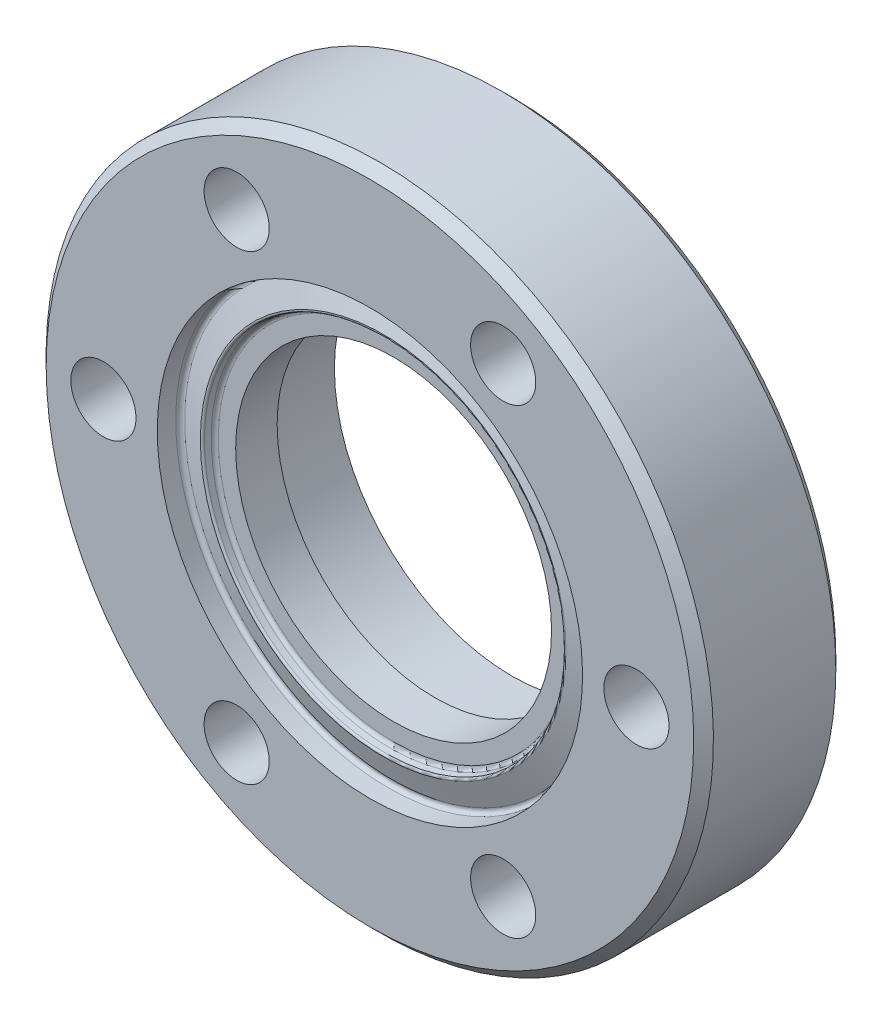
ISO-10303-21;
HEADER;
FILE_DESCRIPTION(('STEP AP214'),'2;1');
FILE_NAME('part.step','',(''),(''),'','','');
FILE_SCHEMA(('AUTOMOTIVE_DESIGN { 1 0 10303 214 1 1 1 1 }'));
ENDSEC;
DATA;
#1=APPLICATION_CONTEXT('core data for automotive mechanical design processes');
#2=APPLICATION_PROTOCOL_DEFINITION('international standard','automotive_design',2000,#1);
#3=PRODUCT_CONTEXT('',#1,'mechanical');
#4=PRODUCT('Part','Part','',(#3));
#5=PRODUCT_RELATED_PRODUCT_CATEGORY('part','',(#4));
#6=PRODUCT_DEFINITION_FORMATION('','',#4);
#7=PRODUCT_DEFINITION_CONTEXT('part definition',#1,'design');
#8=PRODUCT_DEFINITION('design','',#6,#7);
#9=PRODUCT_DEFINITION_SHAPE('','',#8);
#10=(LENGTH_UNIT() NAMED_UNIT(*) SI_UNIT(.MILLI.,.METRE.));
#11=(NAMED_UNIT(*) PLANE_ANGLE_UNIT() SI_UNIT($,.RADIAN.));
#12=(NAMED_UNIT(*) SI_UNIT($,.STERADIAN.) SOLID_ANGLE_UNIT());
#13=UNCERTAINTY_MEASURE_WITH_UNIT(LENGTH_MEASURE(1.E-05),#10,'distance_accuracy_value','');
#14=(GEOMETRIC_REPRESENTATION_CONTEXT(3) GLOBAL_UNCERTAINTY_ASSIGNED_CONTEXT((#13)) GLOBAL_UNIT_ASSIGNED_CONTEXT((#10,
#11,#12)) REPRESENTATION_CONTEXT('',''));
#15=CARTESIAN_POINT('',(0.,0.,0.));
#16=DIRECTION('',(0.,0.,1.));
#17=DIRECTION('',(1.,0.,0.));
#18=AXIS2_PLACEMENT_3D('',#15,#16,#17);
#19=CARTESIAN_POINT('',(0.,0.,6.45263518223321));
#20=DIRECTION('',(0.,0.,1.));
#21=DIRECTION('',(0.,-1.,0.));
#22=AXIS2_PLACEMENT_3D('',#19,#20,#21);
#23=CONICAL_SURFACE('',#22,9.12930541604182,0.174532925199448);
#24=CARTESIAN_POINT('',(0.,0.,6.45263518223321));
#25=DIRECTION('',(0.,0.,1.));
#26=DIRECTION('',(1.,0.,0.));
#27=AXIS2_PLACEMENT_3D('',#24,#25,#26);
#28=CIRCLE('',#27,9.1293054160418);
#29=CARTESIAN_POINT('',(9.12930541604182,0.,6.45263518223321));
#30=VERTEX_POINT('',#29);
#31=EDGE_CURVE('E104',#30,#30,#28,.F.);
#32=ORIENTED_EDGE('',*,*,#31,.F.);
#33=EDGE_LOOP('',(#32));
#34=FACE_BOUND('',#33,.T.);
#35=CARTESIAN_POINT('',(0.,0.,6.16527036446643));
#36=DIRECTION('',(0.,0.,1.));
#37=DIRECTION('',(1.,0.,0.));
#38=AXIS2_PLACEMENT_3D('',#35,#36,#37);
#39=CIRCLE('',#38,9.07863524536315);
#40=CARTESIAN_POINT('',(9.07863524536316,0.,6.16527036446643));
#41=VERTEX_POINT('',#40);
#42=EDGE_CURVE('E107',#41,#41,#39,.F.);
#43=ORIENTED_EDGE('',*,*,#42,.T.);
#44=EDGE_LOOP('',(#43));
#45=FACE_BOUND('',#44,.T.);
#46=ADVANCED_FACE('F16',(#34,#45),#23,.F.);
#47=CARTESIAN_POINT('',(0.,0.,6.43527036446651));
#48=DIRECTION('',(0.,0.,1.));
#49=DIRECTION('',(1.,0.,0.));
#50=AXIS2_PLACEMENT_3D('',#47,#48,#49);
#51=TOROIDAL_SURFACE('',#50,9.22778619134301,0.0999999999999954);
#52=CARTESIAN_POINT('',(0.,0.,6.52923962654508));
#53=DIRECTION('',(0.,0.,-1.));
#54=DIRECTION('',(-1.,0.,0.));
#55=AXIS2_PLACEMENT_3D('',#52,#53,#54);
#56=CIRCLE('',#55,9.26198820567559);
#57=CARTESIAN_POINT('',(-9.26198820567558,0.,6.52923962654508));
#58=VERTEX_POINT('',#57);
#59=EDGE_CURVE('E46',#58,#58,#56,.T.);
#60=ORIENTED_EDGE('',*,*,#59,.F.);
#61=EDGE_LOOP('',(#60));
#62=FACE_BOUND('',#61,.T.);
#63=ORIENTED_EDGE('',*,*,#31,.T.);
#64=EDGE_LOOP('',(#63));
#65=FACE_BOUND('',#64,.T.);
#66=ADVANCED_FACE('F113',(#62,#65),#51,.T.);
#67=CARTESIAN_POINT('',(0.,0.,6.19999999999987));
#68=DIRECTION('',(0.,0.,1.));
#69=DIRECTION('',(1.,0.,0.));
#70=AXIS2_PLACEMENT_3D('',#67,#68,#69);
#71=TOROIDAL_SURFACE('',#70,8.88167369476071,0.200000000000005);
#72=ORIENTED_EDGE('',*,*,#42,.F.);
#73=EDGE_LOOP('',(#72));
#74=FACE_BOUND('',#73,.T.);
#75=CARTESIAN_POINT('',(0.,0.,5.99999999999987));
#76=DIRECTION('',(0.,0.,-1.));
#77=DIRECTION('',(1.,0.,0.));
#78=AXIS2_PLACEMENT_3D('',#75,#76,#77);
#79=CIRCLE('',#78,8.88167369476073);
#80=CARTESIAN_POINT('',(-8.88167369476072,0.,5.99999999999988));
#81=VERTEX_POINT('',#80);
#82=CARTESIAN_POINT('',(8.88167369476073,0.,5.99999999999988));
#83=VERTEX_POINT('',#82);
#84=EDGE_CURVE('E36',#81,#83,#79,.F.);
#85=ORIENTED_EDGE('',*,*,#84,.F.);
#86=CARTESIAN_POINT('',(0.,0.,5.99999999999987));
#87=DIRECTION('',(0.,0.,-1.));
#88=DIRECTION('',(-1.,0.,0.));
#89=AXIS2_PLACEMENT_3D('',#86,#87,#88);
#90=CIRCLE('',#89,8.88167369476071);
#91=EDGE_CURVE('E33',#83,#81,#90,.F.);
#92=ORIENTED_EDGE('',*,*,#91,.F.);
#93=EDGE_LOOP('',(#85,#92));
#94=FACE_BOUND('',#93,.T.);
#95=ADVANCED_FACE('F45',(#74,#94),#71,.F.);
#96=CARTESIAN_POINT('',(0.,0.,6.07805929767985));
#97=DIRECTION('',(0.,0.,-1.));
#98=DIRECTION('',(0.,1.,0.));
#99=AXIS2_PLACEMENT_3D('',#96,#97,#98);
#100=CONICAL_SURFACE('',#99,10.5015959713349,1.22173047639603);
#101=ORIENTED_EDGE('',*,*,#59,.T.);
#102=EDGE_LOOP('',(#101));
#103=FACE_BOUND('',#102,.T.);
#104=CARTESIAN_POINT('',(0.,0.,6.0780592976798));
#105=DIRECTION('',(0.,0.,1.));
#106=DIRECTION('',(1.,0.,0.));
#107=AXIS2_PLACEMENT_3D('',#104,#105,#106);
#108=CIRCLE('',#107,10.501595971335);
#109=CARTESIAN_POINT('',(10.501595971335,0.,6.0780592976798));
#110=VERTEX_POINT('',#109);
#111=EDGE_CURVE('E42',#110,#110,#108,.T.);
#112=ORIENTED_EDGE('',*,*,#111,.T.);
#113=EDGE_LOOP('',(#112));
#114=FACE_BOUND('',#113,.T.);
#115=ADVANCED_FACE('F120',(#103,#114),#100,.T.);
#116=CARTESIAN_POINT('',(0.,0.,5.99999999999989));
#117=DIRECTION('',(0.,0.,1.));
#118=DIRECTION('',(0.,-1.,0.));
#119=AXIS2_PLACEMENT_3D('',#116,#117,#118);
#120=PLANE('',#119);
#121=ORIENTED_EDGE('',*,*,#91,.T.);
#122=ORIENTED_EDGE('',*,*,#84,.T.);
#123=EDGE_LOOP('',(#121,#122));
#124=FACE_BOUND('',#123,.T.);
#125=CARTESIAN_POINT('',(0.,0.,5.99999999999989));
#126=DIRECTION('',(0.,0.,1.));
#127=DIRECTION('',(0.,-1.,0.));
#128=AXIS2_PLACEMENT_3D('',#125,#126,#127);
#129=CIRCLE('',#128,8.);
#130=CARTESIAN_POINT('',(0.,-8.00000000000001,5.99999999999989));
#131=VERTEX_POINT('',#130);
#132=EDGE_CURVE('E48',#131,#131,#129,.F.);
#133=ORIENTED_EDGE('',*,*,#132,.T.);
#134=EDGE_LOOP('',(#133));
#135=FACE_BOUND('',#134,.T.);
#136=ADVANCED_FACE('F38',(#124,#135),#120,.T.);
#137=CARTESIAN_POINT('',(0.,0.,6.26599782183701));
#138=DIRECTION('',(0.,0.,1.));
#139=DIRECTION('',(1.,0.,0.));
#140=AXIS2_PLACEMENT_3D('',#137,#138,#139);
#141=TOROIDAL_SURFACE('',#140,10.57,0.199999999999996);
#142=CARTESIAN_POINT('',(0.,0.,6.26599782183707));
#143=DIRECTION('',(0.,0.,1.));
#144=DIRECTION('',(0.,-1.,0.));
#145=AXIS2_PLACEMENT_3D('',#142,#143,#144);
#146=CIRCLE('',#145,10.77);
#147=CARTESIAN_POINT('',(0.,-10.77,6.26599782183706));
#148=VERTEX_POINT('',#147);
#149=EDGE_CURVE('E51',#148,#148,#146,.T.);
#150=ORIENTED_EDGE('',*,*,#149,.T.);
#151=EDGE_LOOP('',(#150));
#152=FACE_BOUND('',#151,.T.);
#153=ORIENTED_EDGE('',*,*,#111,.F.);
#154=EDGE_LOOP('',(#153));
#155=FACE_BOUND('',#154,.T.);
#156=ADVANCED_FACE('F144',(#152,#155),#141,.F.);
#157=CARTESIAN_POINT('',(0.,0.,31.5));
#158=DIRECTION('',(0.,0.,1.));
#159=DIRECTION('',(0.,-1.,0.));
#160=AXIS2_PLACEMENT_3D('',#157,#158,#159);
#161=CYLINDRICAL_SURFACE('',#160,8.);
#162=CARTESIAN_POINT('',(0.,0.,3.89999999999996));
#163=DIRECTION('',(0.,0.,1.));
#164=DIRECTION('',(0.,-1.,0.));
#165=AXIS2_PLACEMENT_3D('',#162,#163,#164);
#166=CIRCLE('',#165,8.);
#167=CARTESIAN_POINT('',(0.,-8.00000000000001,3.89999999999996));
#168=VERTEX_POINT('',#167);
#169=EDGE_CURVE('E52',#168,#168,#166,.T.);
#170=ORIENTED_EDGE('',*,*,#169,.F.);
#171=EDGE_LOOP('',(#170));
#172=FACE_BOUND('',#171,.T.);
#173=ORIENTED_EDGE('',*,*,#132,.F.);
#174=EDGE_LOOP('',(#173));
#175=FACE_BOUND('',#174,.T.);
#176=ADVANCED_FACE('F230',(#172,#175),#161,.F.);
#177=CARTESIAN_POINT('',(0.,0.,6.69999999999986));
#178=DIRECTION('',(0.,0.,-1.));
#179=DIRECTION('',(0.,1.,0.));
#180=AXIS2_PLACEMENT_3D('',#177,#178,#179);
#181=CONICAL_SURFACE('',#180,16.9,0.785398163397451);
#182=CARTESIAN_POINT('',(0.,0.,6.69999999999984));
#183=DIRECTION('',(0.,0.,-1.));
#184=DIRECTION('',(0.,1.,0.));
#185=AXIS2_PLACEMENT_3D('',#182,#183,#184);
#186=CIRCLE('',#185,16.9);
#187=CARTESIAN_POINT('',(0.,16.9,6.69999999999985));
#188=VERTEX_POINT('',#187);
#189=EDGE_CURVE('E55',#188,#188,#186,.T.);
#190=ORIENTED_EDGE('',*,*,#189,.F.);
#191=EDGE_LOOP('',(#190));
#192=FACE_BOUND('',#191,.T.);
#193=CARTESIAN_POINT('',(0.,0.,7.19999999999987));
#194=DIRECTION('',(0.,0.,-1.));
#195=DIRECTION('',(0.,1.,0.));
#196=AXIS2_PLACEMENT_3D('',#193,#194,#195);
#197=CIRCLE('',#196,16.4);
#198=CARTESIAN_POINT('',(0.,16.4,7.19999999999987));
#199=VERTEX_POINT('',#198);
#200=EDGE_CURVE('E56',#199,#199,#197,.F.);
#201=ORIENTED_EDGE('',*,*,#200,.F.);
#202=EDGE_LOOP('',(#201));
#203=FACE_BOUND('',#202,.T.);
#204=ADVANCED_FACE('F233',(#192,#203),#181,.T.);
#205=CARTESIAN_POINT('',(0.,0.,31.6838263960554));
#206=DIRECTION('',(0.,0.,1.));
#207=DIRECTION('',(0.,-1.,0.));
#208=AXIS2_PLACEMENT_3D('',#205,#206,#207);
#209=CYLINDRICAL_SURFACE('',#208,10.77);
#210=CARTESIAN_POINT('',(0.,0.,7.19999999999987));
#211=DIRECTION('',(0.,0.,1.));
#212=DIRECTION('',(0.,-1.,0.));
#213=AXIS2_PLACEMENT_3D('',#210,#211,#212);
#214=CIRCLE('',#213,10.77);
#215=CARTESIAN_POINT('',(0.,-10.77,7.19999999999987));
#216=VERTEX_POINT('',#215);
#217=EDGE_CURVE('E59',#216,#216,#214,.F.);
#218=ORIENTED_EDGE('',*,*,#217,.F.);
#219=EDGE_LOOP('',(#218));
#220=FACE_BOUND('',#219,.T.);
#221=ORIENTED_EDGE('',*,*,#149,.F.);
#222=EDGE_LOOP('',(#221));
#223=FACE_BOUND('',#222,.T.);
#224=ADVANCED_FACE('F180',(#220,#223),#209,.F.);
#225=CARTESIAN_POINT('',(0.,0.,3.89999999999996));
#226=DIRECTION('',(0.,0.,-1.));
#227=DIRECTION('',(0.,1.,0.));
#228=AXIS2_PLACEMENT_3D('',#225,#226,#227);
#229=PLANE('',#228);
#230=CARTESIAN_POINT('',(0.,0.,3.89999999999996));
#231=DIRECTION('',(0.,0.,-1.));
#232=DIRECTION('',(0.,1.,0.));
#233=AXIS2_PLACEMENT_3D('',#230,#231,#232);
#234=CIRCLE('',#233,9.);
#235=CARTESIAN_POINT('',(0.,8.99999999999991,3.89999999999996));
#236=VERTEX_POINT('',#235);
#237=EDGE_CURVE('E62',#236,#236,#234,.T.);
#238=ORIENTED_EDGE('',*,*,#237,.T.);
#239=EDGE_LOOP('',(#238));
#240=FACE_BOUND('',#239,.T.);
#241=ORIENTED_EDGE('',*,*,#169,.T.);
#242=EDGE_LOOP('',(#241));
#243=FACE_BOUND('',#242,.T.);
#244=ADVANCED_FACE('F169',(#240,#243),#229,.T.);
#245=CARTESIAN_POINT('',(0.,0.,7.19999999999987));
#246=DIRECTION('',(0.,0.,-1.));
#247=DIRECTION('',(0.,1.,0.));
#248=AXIS2_PLACEMENT_3D('',#245,#246,#247);
#249=CYLINDRICAL_SURFACE('',#248,16.9);
#250=ORIENTED_EDGE('',*,*,#189,.T.);
#251=EDGE_LOOP('',(#250));
#252=FACE_BOUND('',#251,.T.);
#253=CARTESIAN_POINT('',(0.,0.,0.499999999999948));
#254=DIRECTION('',(0.,0.,1.));
#255=DIRECTION('',(1.,0.,0.));
#256=AXIS2_PLACEMENT_3D('',#253,#254,#255);
#257=CIRCLE('',#256,16.9);
#258=CARTESIAN_POINT('',(16.9,0.,0.49999999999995));
#259=VERTEX_POINT('',#258);
#260=EDGE_CURVE('E65',#259,#259,#257,.F.);
#261=ORIENTED_EDGE('',*,*,#260,.F.);
#262=EDGE_LOOP('',(#261));
#263=FACE_BOUND('',#262,.T.);
#264=ADVANCED_FACE('F166',(#252,#263),#249,.T.);
#265=CARTESIAN_POINT('',(0.,0.,7.19999999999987));
#266=DIRECTION('',(0.,0.,1.));
#267=DIRECTION('',(0.,-1.,0.));
#268=AXIS2_PLACEMENT_3D('',#265,#266,#267);
#269=PLANE('',#268);
#270=ORIENTED_EDGE('',*,*,#217,.T.);
#271=EDGE_LOOP('',(#270));
#272=FACE_BOUND('',#271,.T.);
#273=CARTESIAN_POINT('',(13.5,1.04083408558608E-13,7.19999999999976));
#274=DIRECTION('',(0.,0.,1.));
#275=DIRECTION('',(0.,-1.,0.));
#276=AXIS2_PLACEMENT_3D('',#273,#274,#275);
#277=CIRCLE('',#276,1.65);
#278=CARTESIAN_POINT('',(13.5,-1.64999999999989,7.19999999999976));
#279=VERTEX_POINT('',#278);
#280=EDGE_CURVE('E81',#279,#279,#277,.F.);
#281=ORIENTED_EDGE('',*,*,#280,.T.);
#282=EDGE_LOOP('',(#281));
#283=FACE_BOUND('',#282,.T.);
#284=CARTESIAN_POINT('',(6.75000000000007,-11.69134295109,7.19999999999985));
#285=DIRECTION('',(0.,0.,1.));
#286=DIRECTION('',(0.,-1.,0.));
#287=AXIS2_PLACEMENT_3D('',#284,#285,#286);
#288=CIRCLE('',#287,1.65);
#289=CARTESIAN_POINT('',(6.75000000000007,-13.34134295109,7.19999999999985));
#290=VERTEX_POINT('',#289);
#291=EDGE_CURVE('E78',#290,#290,#288,.F.);
#292=ORIENTED_EDGE('',*,*,#291,.T.);
#293=EDGE_LOOP('',(#292));
#294=FACE_BOUND('',#293,.T.);
#295=CARTESIAN_POINT('',(-6.74999999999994,-11.6913429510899,7.19999999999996));
#296=DIRECTION('',(0.,0.,1.));
#297=DIRECTION('',(0.,-1.,0.));
#298=AXIS2_PLACEMENT_3D('',#295,#296,#297);
#299=CIRCLE('',#298,1.65);
#300=CARTESIAN_POINT('',(-6.74999999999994,-13.3413429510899,7.19999999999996));
#301=VERTEX_POINT('',#300);
#302=EDGE_CURVE('E75',#301,#301,#299,.F.);
#303=ORIENTED_EDGE('',*,*,#302,.T.);
#304=EDGE_LOOP('',(#303));
#305=FACE_BOUND('',#304,.T.);
#306=CARTESIAN_POINT('',(-13.5,-1.31838984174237E-13,7.19999999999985));
#307=DIRECTION('',(0.,0.,1.));
#308=DIRECTION('',(0.,-1.,0.));
#309=AXIS2_PLACEMENT_3D('',#306,#307,#308);
#310=CIRCLE('',#309,1.65);
#311=CARTESIAN_POINT('',(-13.5,-1.65000000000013,7.19999999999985));
#312=VERTEX_POINT('',#311);
#313=EDGE_CURVE('E72',#312,#312,#310,.F.);
#314=ORIENTED_EDGE('',*,*,#313,.T.);
#315=EDGE_LOOP('',(#314));
#316=FACE_BOUND('',#315,.T.);
#317=CARTESIAN_POINT('',(-6.74999999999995,11.6913429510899,7.19999999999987));
#318=DIRECTION('',(0.,0.,1.));
#319=DIRECTION('',(0.,-1.,0.));
#320=AXIS2_PLACEMENT_3D('',#317,#318,#319);
#321=CIRCLE('',#320,1.65);
#322=CARTESIAN_POINT('',(-6.74999999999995,10.0413429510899,7.19999999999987));
#323=VERTEX_POINT('',#322);
#324=EDGE_CURVE('E69',#323,#323,#321,.F.);
#325=ORIENTED_EDGE('',*,*,#324,.T.);
#326=EDGE_LOOP('',(#325));
#327=FACE_BOUND('',#326,.T.);
#328=CARTESIAN_POINT('',(6.74999999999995,11.6913429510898,7.19999999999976));
#329=DIRECTION('',(0.,0.,1.));
#330=DIRECTION('',(0.,-1.,0.));
#331=AXIS2_PLACEMENT_3D('',#328,#329,#330);
#332=CIRCLE('',#331,1.65);
#333=CARTESIAN_POINT('',(6.74999999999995,10.0413429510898,7.19999999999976));
#334=VERTEX_POINT('',#333);
#335=EDGE_CURVE('E66',#334,#334,#332,.F.);
#336=ORIENTED_EDGE('',*,*,#335,.T.);
#337=EDGE_LOOP('',(#336));
#338=FACE_BOUND('',#337,.T.);
#339=ORIENTED_EDGE('',*,*,#200,.T.);
#340=EDGE_LOOP('',(#339));
#341=FACE_BOUND('',#340,.T.);
#342=ADVANCED_FACE('F168',(#272,#283,#294,#305,#316,#327,#338,#341),#269,.T.);
#343=CARTESIAN_POINT('',(0.,0.,3.89999999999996));
#344=DIRECTION('',(0.,0.,-1.));
#345=DIRECTION('',(0.,1.,0.));
#346=AXIS2_PLACEMENT_3D('',#343,#344,#345);
#347=CYLINDRICAL_SURFACE('',#346,9.);
#348=ORIENTED_EDGE('',*,*,#237,.F.);
#349=EDGE_LOOP('',(#348));
#350=FACE_BOUND('',#349,.T.);
#351=CARTESIAN_POINT('',(0.,0.,0.));
#352=DIRECTION('',(0.,0.,-1.));
#353=DIRECTION('',(0.,1.,0.));
#354=AXIS2_PLACEMENT_3D('',#351,#352,#353);
#355=CIRCLE('',#354,9.);
#356=CARTESIAN_POINT('',(0.,8.99999999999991,0.));
#357=VERTEX_POINT('',#356);
#358=EDGE_CURVE('E84',#357,#357,#355,.T.);
#359=ORIENTED_EDGE('',*,*,#358,.T.);
#360=EDGE_LOOP('',(#359));
#361=FACE_BOUND('',#360,.T.);
#362=ADVANCED_FACE('F177',(#350,#361),#347,.F.);
#363=CARTESIAN_POINT('',(0.,0.,0.499999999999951));
#364=DIRECTION('',(0.,0.,1.));
#365=DIRECTION('',(0.,-1.,0.));
#366=AXIS2_PLACEMENT_3D('',#363,#364,#365);
#367=CONICAL_SURFACE('',#366,16.9,0.785398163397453);
#368=CARTESIAN_POINT('',(0.,0.,0.));
#369=DIRECTION('',(0.,0.,1.));
#370=DIRECTION('',(0.,-1.,0.));
#371=AXIS2_PLACEMENT_3D('',#368,#369,#370);
#372=CIRCLE('',#371,16.4);
#373=CARTESIAN_POINT('',(0.,-16.4,0.));
#374=VERTEX_POINT('',#373);
#375=EDGE_CURVE('E87',#374,#374,#372,.T.);
#376=ORIENTED_EDGE('',*,*,#375,.T.);
#377=EDGE_LOOP('',(#376));
#378=FACE_BOUND('',#377,.T.);
#379=ORIENTED_EDGE('',*,*,#260,.T.);
#380=EDGE_LOOP('',(#379));
#381=FACE_BOUND('',#380,.T.);
#382=ADVANCED_FACE('F164',(#378,#381),#367,.T.);
#383=CARTESIAN_POINT('',(6.74999999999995,11.6913429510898,7.19999999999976));
#384=DIRECTION('',(0.,0.,1.));
#385=DIRECTION('',(0.,-1.,0.));
#386=AXIS2_PLACEMENT_3D('',#383,#384,#385);
#387=CYLINDRICAL_SURFACE('',#386,1.65);
#388=CARTESIAN_POINT('',(6.74999999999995,11.6913429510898,0.));
#389=DIRECTION('',(0.,0.,1.));
#390=DIRECTION('',(0.,-1.,0.));
#391=AXIS2_PLACEMENT_3D('',#388,#389,#390);
#392=CIRCLE('',#391,1.65);
#393=CARTESIAN_POINT('',(6.74999999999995,10.0413429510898,0.));
#394=VERTEX_POINT('',#393);
#395=EDGE_CURVE('E90',#394,#394,#392,.F.);
#396=ORIENTED_EDGE('',*,*,#395,.T.);
#397=EDGE_LOOP('',(#396));
#398=FACE_BOUND('',#397,.T.);
#399=ORIENTED_EDGE('',*,*,#335,.F.);
#400=EDGE_LOOP('',(#399));
#401=FACE_BOUND('',#400,.T.);
#402=ADVANCED_FACE('F211',(#398,#401),#387,.F.);
#403=CARTESIAN_POINT('',(-6.74999999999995,11.6913429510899,7.19999999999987));
#404=DIRECTION('',(0.,0.,1.));
#405=DIRECTION('',(0.,-1.,0.));
#406=AXIS2_PLACEMENT_3D('',#403,#404,#405);
#407=CYLINDRICAL_SURFACE('',#406,1.65);
#408=CARTESIAN_POINT('',(-6.74999999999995,11.6913429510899,-2.4980018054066E-13));
#409=DIRECTION('',(0.,0.,1.));
#410=DIRECTION('',(0.,-1.,0.));
#411=AXIS2_PLACEMENT_3D('',#408,#409,#410);
#412=CIRCLE('',#411,1.65);
#413=CARTESIAN_POINT('',(-6.74999999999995,10.0413429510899,-2.50074960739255E-13));
#414=VERTEX_POINT('',#413);
#415=EDGE_CURVE('E93',#414,#414,#412,.F.);
#416=ORIENTED_EDGE('',*,*,#415,.T.);
#417=EDGE_LOOP('',(#416));
#418=FACE_BOUND('',#417,.T.);
#419=ORIENTED_EDGE('',*,*,#324,.F.);
#420=EDGE_LOOP('',(#419));
#421=FACE_BOUND('',#420,.T.);
#422=ADVANCED_FACE('F207',(#418,#421),#407,.F.);
#423=CARTESIAN_POINT('',(-13.5,-1.31838984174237E-13,7.19999999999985));
#424=DIRECTION('',(0.,0.,1.));
#425=DIRECTION('',(0.,-1.,0.));
#426=AXIS2_PLACEMENT_3D('',#423,#424,#425);
#427=CYLINDRICAL_SURFACE('',#426,1.65);
#428=CARTESIAN_POINT('',(-13.5,-1.30639943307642E-13,-1.11022302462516E-13));
#429=DIRECTION('',(0.,0.,1.));
#430=DIRECTION('',(0.,-1.,0.));
#431=AXIS2_PLACEMENT_3D('',#428,#429,#430);
#432=CIRCLE('',#431,1.65);
#433=CARTESIAN_POINT('',(-13.5,-1.65000000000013,-1.1129708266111E-13));
#434=VERTEX_POINT('',#433);
#435=EDGE_CURVE('E96',#434,#434,#432,.F.);
#436=ORIENTED_EDGE('',*,*,#435,.T.);
#437=EDGE_LOOP('',(#436));
#438=FACE_BOUND('',#437,.T.);
#439=ORIENTED_EDGE('',*,*,#313,.F.);
#440=EDGE_LOOP('',(#439));
#441=FACE_BOUND('',#440,.T.);
#442=ADVANCED_FACE('F203',(#438,#441),#427,.F.);
#443=CARTESIAN_POINT('',(-6.74999999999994,-11.6913429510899,7.19999999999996));
#444=DIRECTION('',(0.,0.,1.));
#445=DIRECTION('',(0.,-1.,0.));
#446=AXIS2_PLACEMENT_3D('',#443,#444,#445);
#447=CYLINDRICAL_SURFACE('',#446,1.65);
#448=CARTESIAN_POINT('',(-6.74999999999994,-11.6913429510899,-1.66533453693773E-13));
#449=DIRECTION('',(0.,0.,1.));
#450=DIRECTION('',(0.,-1.,0.));
#451=AXIS2_PLACEMENT_3D('',#448,#449,#450);
#452=CIRCLE('',#451,1.65);
#453=CARTESIAN_POINT('',(-6.74999999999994,-13.3413429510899,-1.66808233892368E-13));
#454=VERTEX_POINT('',#453);
#455=EDGE_CURVE('E99',#454,#454,#452,.F.);
#456=ORIENTED_EDGE('',*,*,#455,.T.);
#457=EDGE_LOOP('',(#456));
#458=FACE_BOUND('',#457,.T.);
#459=ORIENTED_EDGE('',*,*,#302,.F.);
#460=EDGE_LOOP('',(#459));
#461=FACE_BOUND('',#460,.T.);
#462=ADVANCED_FACE('F199',(#458,#461),#447,.F.);
#463=CARTESIAN_POINT('',(6.75000000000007,-11.69134295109,7.19999999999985));
#464=DIRECTION('',(0.,0.,1.));
#465=DIRECTION('',(0.,-1.,0.));
#466=AXIS2_PLACEMENT_3D('',#463,#464,#465);
#467=CYLINDRICAL_SURFACE('',#466,1.65);
#468=CARTESIAN_POINT('',(6.75000000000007,-11.69134295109,0.));
#469=DIRECTION('',(0.,0.,1.));
#470=DIRECTION('',(0.,-1.,0.));
#471=AXIS2_PLACEMENT_3D('',#468,#469,#470);
#472=CIRCLE('',#471,1.65);
#473=CARTESIAN_POINT('',(6.75000000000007,-13.34134295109,0.));
#474=VERTEX_POINT('',#473);
#475=EDGE_CURVE('E27',#474,#474,#472,.F.);
#476=ORIENTED_EDGE('',*,*,#475,.T.);
#477=EDGE_LOOP('',(#476));
#478=FACE_BOUND('',#477,.T.);
#479=ORIENTED_EDGE('',*,*,#291,.F.);
#480=EDGE_LOOP('',(#479));
#481=FACE_BOUND('',#480,.T.);
#482=ADVANCED_FACE('F191',(#478,#481),#467,.F.);
#483=CARTESIAN_POINT('',(13.5,1.04083408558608E-13,7.19999999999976));
#484=DIRECTION('',(0.,0.,1.));
#485=DIRECTION('',(0.,-1.,0.));
#486=AXIS2_PLACEMENT_3D('',#483,#484,#485);
#487=CYLINDRICAL_SURFACE('',#486,1.65);
#488=CARTESIAN_POINT('',(13.5,1.05282449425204E-13,0.));
#489=DIRECTION('',(0.,0.,1.));
#490=DIRECTION('',(0.,-1.,0.));
#491=AXIS2_PLACEMENT_3D('',#488,#489,#490);
#492=CIRCLE('',#491,1.65);
#493=CARTESIAN_POINT('',(13.5,-1.64999999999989,0.));
#494=VERTEX_POINT('',#493);
#495=EDGE_CURVE('E11',#494,#494,#492,.F.);
#496=ORIENTED_EDGE('',*,*,#495,.T.);
#497=EDGE_LOOP('',(#496));
#498=FACE_BOUND('',#497,.T.);
#499=ORIENTED_EDGE('',*,*,#280,.F.);
#500=EDGE_LOOP('',(#499));
#501=FACE_BOUND('',#500,.T.);
#502=ADVANCED_FACE('F185',(#498,#501),#487,.F.);
#503=CARTESIAN_POINT('',(0.,0.,0.));
#504=DIRECTION('',(0.,0.,1.));
#505=DIRECTION('',(0.,-1.,0.));
#506=AXIS2_PLACEMENT_3D('',#503,#504,#505);
#507=PLANE('',#506);
#508=ORIENTED_EDGE('',*,*,#495,.F.);
#509=EDGE_LOOP('',(#508));
#510=FACE_BOUND('',#509,.T.);
#511=ORIENTED_EDGE('',*,*,#475,.F.);
#512=EDGE_LOOP('',(#511));
#513=FACE_BOUND('',#512,.T.);
#514=ORIENTED_EDGE('',*,*,#455,.F.);
#515=EDGE_LOOP('',(#514));
#516=FACE_BOUND('',#515,.T.);
#517=ORIENTED_EDGE('',*,*,#435,.F.);
#518=EDGE_LOOP('',(#517));
#519=FACE_BOUND('',#518,.T.);
#520=ORIENTED_EDGE('',*,*,#415,.F.);
#521=EDGE_LOOP('',(#520));
#522=FACE_BOUND('',#521,.T.);
#523=ORIENTED_EDGE('',*,*,#395,.F.);
#524=EDGE_LOOP('',(#523));
#525=FACE_BOUND('',#524,.T.);
#526=ORIENTED_EDGE('',*,*,#375,.F.);
#527=EDGE_LOOP('',(#526));
#528=FACE_BOUND('',#527,.T.);
#529=ORIENTED_EDGE('',*,*,#358,.F.);
#530=EDGE_LOOP('',(#529));
#531=FACE_BOUND('',#530,.T.);
#532=ADVANCED_FACE('F183',(#510,#513,#516,#519,#522,#525,#528,#531),#507,.F.);
#533=CLOSED_SHELL('',(#46,#66,#95,#115,#136,#156,#176,#204,#224,#244,#264,#342,#362,#382,#402,
#422,#442,#462,#482,#502,#532));
#534=MANIFOLD_SOLID_BREP('B1',#533);
#535=ADVANCED_BREP_SHAPE_REPRESENTATION('',(#18,#534),#14);
#536=SHAPE_DEFINITION_REPRESENTATION(#9,#535);
ENDSEC;
END-ISO-10303-21;
